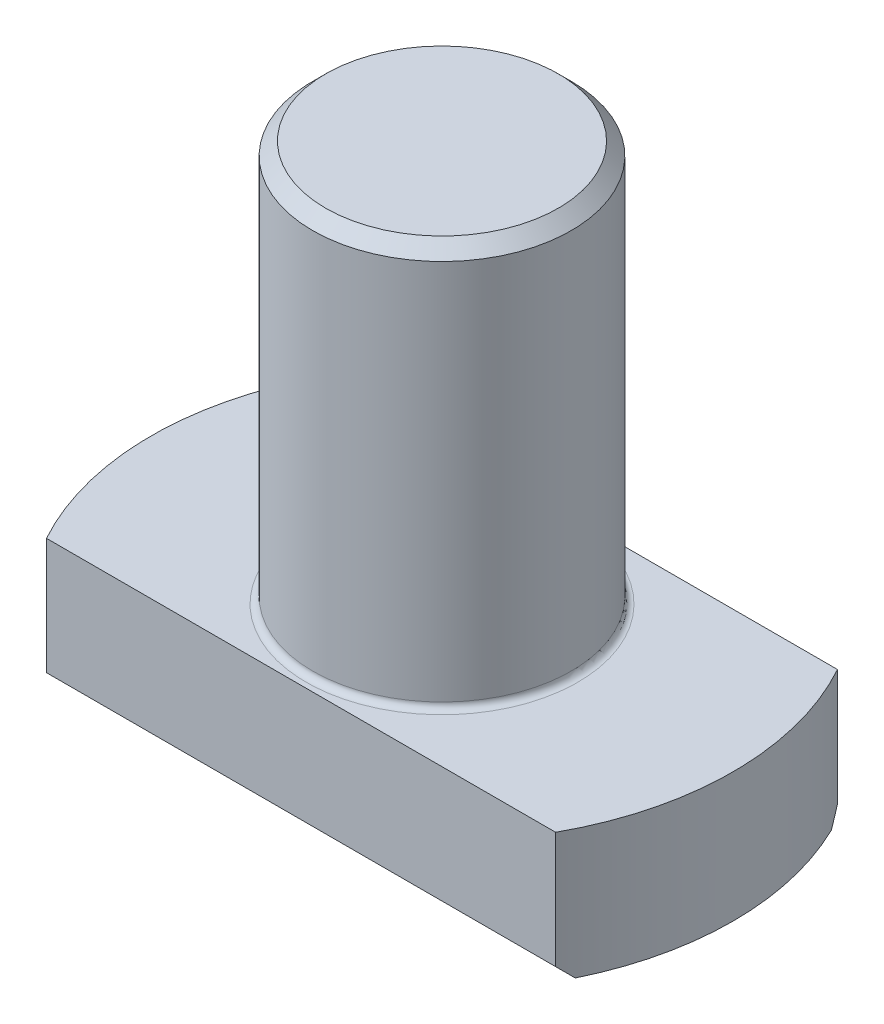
from build123d import *

# Parameters (mm, degrees)
ESQUISSE2_R        = 10
BOSS_EXTRU_1_DEPTH = 31
CHANFREIN1_SIZE    = 1
BOSS_EXTRU_2_DEPTH = 10
CHANFREIN2_SIZE    = 1
CONG_1_R           = 0.5


with BuildPart() as part:
    # Esquisse2 → Boss.-Extru.1 (new body)
    with BuildSketch(Plane(origin=(0, 0, 0), x_dir=(1, 0, 0), z_dir=(0, 1, 0))):
        with Locations(Location((0, 0, 0), (0, 0, 270))):
            Circle(ESQUISSE2_R)
    extrude(amount=BOSS_EXTRU_1_DEPTH)

    # Chanfrein1
    chanfrein1_edges = [part.edges().sort_by_distance(p)[0] for p in [
        (0, 31, -10),
    ]]
    chamfer(chanfrein1_edges, length=CHANFREIN1_SIZE)

    # Esquisse3 → Boss.-Extru.2 (add)
    with BuildSketch(Plane.XZ):
        with BuildLine():
            Line((-19.683495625, 10.9), (19.683495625, 10.9))
            ThreePointArc((19.683495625, 10.9), (22.5, 0), (19.683495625, -10.9))
            Line((19.683495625, -10.9), (-19.683495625, -10.9))
            ThreePointArc((-19.683495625, -10.9), (-22.5, 0), (-19.683495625, 10.9))
        make_face()
    extrude(amount=BOSS_EXTRU_2_DEPTH)

    # Chanfrein2
    chanfrein2_edges = [part.edges().sort_by_distance(p)[0] for p in [
        (0, -10, -10.9),
        (0, -10, 10.9),
    ]]
    chamfer(chanfrein2_edges, length=CHANFREIN2_SIZE)

    # Cong_1
    cong_1_edges = [part.edges().sort_by_distance(p)[0] for p in [
        (0, 0, -10),
    ]]
    fillet(cong_1_edges, radius=CONG_1_R)


solid = part.part
